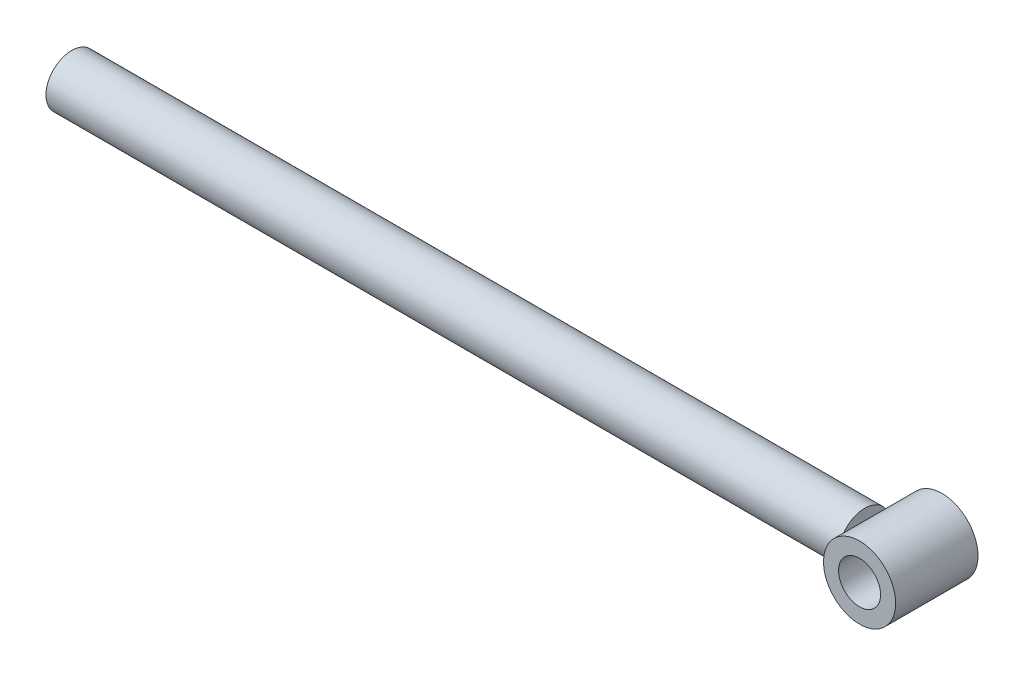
from build123d import *

# Parameters (mm, degrees)
ESQUISSE1_R      = 12.5
EXTRUSION1_DEPTH = 385
ESQUISSE2_R      = 17.5
ESQUISSE2_R_2    = 10.2
EXTRUSION2_DEPTH = 20


with BuildPart() as part:
    # Esquisse1 → Extrusion1 (new body)
    with BuildSketch(Plane(origin=(0, 0, 0), x_dir=(0, 0, -1), z_dir=(1, 0, 0))):
        Circle(ESQUISSE1_R)
    extrude(amount=EXTRUSION1_DEPTH)


with BuildPart() as body_2:
    # Esquisse2 → Extrusion2 (new, symmetric)
    with BuildSketch(Plane.XY):
        with Locations((402.5, 0)):
            Circle(ESQUISSE2_R)
        with Locations((402.5, 0)):
            Circle(ESQUISSE2_R_2, mode=Mode.SUBTRACT)
    extrude(amount=EXTRUSION2_DEPTH, both=True)


solid = Compound([part.part, body_2.part])
